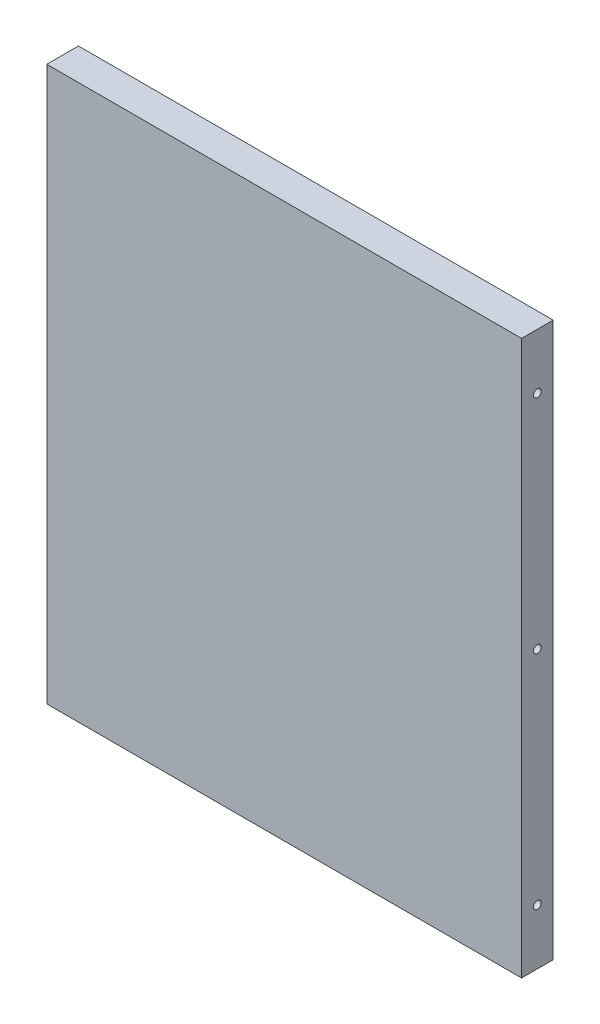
ISO-10303-21;
HEADER;
FILE_DESCRIPTION(('STEP AP214'),'2;1');
FILE_NAME('part.step','',(''),(''),'','','');
FILE_SCHEMA(('AUTOMOTIVE_DESIGN { 1 0 10303 214 1 1 1 1 }'));
ENDSEC;
DATA;
#1=APPLICATION_CONTEXT('core data for automotive mechanical design processes');
#2=APPLICATION_PROTOCOL_DEFINITION('international standard','automotive_design',2000,#1);
#3=PRODUCT_CONTEXT('',#1,'mechanical');
#4=PRODUCT('Part','Part','',(#3));
#5=PRODUCT_RELATED_PRODUCT_CATEGORY('part','',(#4));
#6=PRODUCT_DEFINITION_FORMATION('','',#4);
#7=PRODUCT_DEFINITION_CONTEXT('part definition',#1,'design');
#8=PRODUCT_DEFINITION('design','',#6,#7);
#9=PRODUCT_DEFINITION_SHAPE('','',#8);
#10=(LENGTH_UNIT() NAMED_UNIT(*) SI_UNIT(.MILLI.,.METRE.));
#11=(NAMED_UNIT(*) PLANE_ANGLE_UNIT() SI_UNIT($,.RADIAN.));
#12=(NAMED_UNIT(*) SI_UNIT($,.STERADIAN.) SOLID_ANGLE_UNIT());
#13=UNCERTAINTY_MEASURE_WITH_UNIT(LENGTH_MEASURE(1.E-05),#10,'distance_accuracy_value','');
#14=(GEOMETRIC_REPRESENTATION_CONTEXT(3) GLOBAL_UNCERTAINTY_ASSIGNED_CONTEXT((#13)) GLOBAL_UNIT_ASSIGNED_CONTEXT((#10,
#11,#12)) REPRESENTATION_CONTEXT('',''));
#15=CARTESIAN_POINT('',(0.,0.,0.));
#16=DIRECTION('',(0.,0.,1.));
#17=DIRECTION('',(1.,0.,0.));
#18=AXIS2_PLACEMENT_3D('',#15,#16,#17);
#19=CARTESIAN_POINT('',(-84.7009024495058,65.5769230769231,10.));
#20=DIRECTION('',(1.,0.,0.));
#21=DIRECTION('',(0.,1.,0.));
#22=AXIS2_PLACEMENT_3D('',#19,#20,#21);
#23=PLANE('',#22);
#24=CARTESIAN_POINT('',(-84.7009024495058,48.0769230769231,4.99999999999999));
#25=DIRECTION('',(-1.,0.,0.));
#26=DIRECTION('',(0.,-1.,0.));
#27=AXIS2_PLACEMENT_3D('',#24,#25,#26);
#28=CIRCLE('',#27,1.25);
#29=CARTESIAN_POINT('',(-84.7009024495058,46.8269230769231,4.99999999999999));
#30=VERTEX_POINT('',#29);
#31=EDGE_CURVE('E122',#30,#30,#28,.T.);
#32=ORIENTED_EDGE('',*,*,#31,.F.);
#33=EDGE_LOOP('',(#32));
#34=FACE_BOUND('',#33,.T.);
#35=CARTESIAN_POINT('',(-84.7009024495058,-21.9230769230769,5.));
#36=DIRECTION('',(-1.,0.,0.));
#37=DIRECTION('',(0.,-1.,0.));
#38=AXIS2_PLACEMENT_3D('',#35,#36,#37);
#39=CIRCLE('',#38,1.25);
#40=CARTESIAN_POINT('',(-84.7009024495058,-23.1730769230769,5.));
#41=VERTEX_POINT('',#40);
#42=EDGE_CURVE('E116',#41,#41,#39,.T.);
#43=ORIENTED_EDGE('',*,*,#42,.F.);
#44=EDGE_LOOP('',(#43));
#45=FACE_BOUND('',#44,.T.);
#46=CARTESIAN_POINT('',(-84.7009024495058,-91.9230769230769,4.99999999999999));
#47=DIRECTION('',(-1.,0.,0.));
#48=DIRECTION('',(0.,-1.,0.));
#49=AXIS2_PLACEMENT_3D('',#46,#47,#48);
#50=CIRCLE('',#49,1.23);
#51=CARTESIAN_POINT('',(-84.7009024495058,-93.1530769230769,4.99999999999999));
#52=VERTEX_POINT('',#51);
#53=EDGE_CURVE('E109',#52,#52,#50,.T.);
#54=ORIENTED_EDGE('',*,*,#53,.F.);
#55=EDGE_LOOP('',(#54));
#56=FACE_BOUND('',#55,.T.);
#57=DIRECTION('',(0.,-1.,0.));
#58=VECTOR('',#57,1.);
#59=CARTESIAN_POINT('',(-84.7009024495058,65.5769230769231,0.));
#60=LINE('',#59,#58);
#61=CARTESIAN_POINT('',(-84.7009024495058,65.5769230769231,0.));
#62=VERTEX_POINT('',#61);
#63=CARTESIAN_POINT('',(-84.7009024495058,-109.423076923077,0.));
#64=VERTEX_POINT('',#63);
#65=EDGE_CURVE('E95',#62,#64,#60,.T.);
#66=ORIENTED_EDGE('',*,*,#65,.T.);
#67=DIRECTION('',(0.,0.,-1.));
#68=VECTOR('',#67,1.);
#69=CARTESIAN_POINT('',(-84.7009024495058,-109.423076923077,10.));
#70=LINE('',#69,#68);
#71=CARTESIAN_POINT('',(-84.7009024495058,-109.423076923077,10.));
#72=VERTEX_POINT('',#71);
#73=EDGE_CURVE('E11',#72,#64,#70,.T.);
#74=ORIENTED_EDGE('',*,*,#73,.F.);
#75=DIRECTION('',(0.,-1.,0.));
#76=VECTOR('',#75,1.);
#77=CARTESIAN_POINT('',(-84.7009024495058,65.5769230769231,10.));
#78=LINE('',#77,#76);
#79=CARTESIAN_POINT('',(-84.7009024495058,65.5769230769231,10.));
#80=VERTEX_POINT('',#79);
#81=EDGE_CURVE('E83',#80,#72,#78,.T.);
#82=ORIENTED_EDGE('',*,*,#81,.F.);
#83=DIRECTION('',(0.,0.,-1.));
#84=VECTOR('',#83,1.);
#85=CARTESIAN_POINT('',(-84.7009024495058,65.5769230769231,10.));
#86=LINE('',#85,#84);
#87=EDGE_CURVE('E91',#80,#62,#86,.T.);
#88=ORIENTED_EDGE('',*,*,#87,.T.);
#89=EDGE_LOOP('',(#66,#74,#82,#88));
#90=FACE_BOUND('',#89,.T.);
#91=ADVANCED_FACE('F32',(#34,#45,#56,#90),#23,.F.);
#92=CARTESIAN_POINT('',(-84.7009024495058,-109.423076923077,10.));
#93=DIRECTION('',(0.,1.,0.));
#94=DIRECTION('',(0.,0.,1.));
#95=AXIS2_PLACEMENT_3D('',#92,#93,#94);
#96=PLANE('',#95);
#97=DIRECTION('',(1.,0.,0.));
#98=VECTOR('',#97,1.);
#99=CARTESIAN_POINT('',(-84.7009024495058,-109.423076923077,0.));
#100=LINE('',#99,#98);
#101=CARTESIAN_POINT('',(65.2990975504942,-109.423076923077,0.));
#102=VERTEX_POINT('',#101);
#103=EDGE_CURVE('E87',#64,#102,#100,.T.);
#104=ORIENTED_EDGE('',*,*,#103,.T.);
#105=DIRECTION('',(0.,0.,-1.));
#106=VECTOR('',#105,1.);
#107=CARTESIAN_POINT('',(65.2990975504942,-109.423076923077,10.));
#108=LINE('',#107,#106);
#109=CARTESIAN_POINT('',(65.2990975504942,-109.423076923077,10.));
#110=VERTEX_POINT('',#109);
#111=EDGE_CURVE('E40',#110,#102,#108,.T.);
#112=ORIENTED_EDGE('',*,*,#111,.F.);
#113=DIRECTION('',(1.,0.,0.));
#114=VECTOR('',#113,1.);
#115=CARTESIAN_POINT('',(-84.7009024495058,-109.423076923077,10.));
#116=LINE('',#115,#114);
#117=EDGE_CURVE('E78',#72,#110,#116,.T.);
#118=ORIENTED_EDGE('',*,*,#117,.F.);
#119=ORIENTED_EDGE('',*,*,#73,.T.);
#120=EDGE_LOOP('',(#104,#112,#118,#119));
#121=FACE_BOUND('',#120,.T.);
#122=ADVANCED_FACE('F86',(#121),#96,.F.);
#123=CARTESIAN_POINT('',(65.2990975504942,65.5769230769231,10.));
#124=DIRECTION('',(-1.,0.,0.));
#125=DIRECTION('',(0.,-1.,0.));
#126=AXIS2_PLACEMENT_3D('',#123,#124,#125);
#127=PLANE('',#126);
#128=CARTESIAN_POINT('',(65.2990975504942,48.0769230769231,5.));
#129=DIRECTION('',(1.,0.,0.));
#130=DIRECTION('',(0.,1.,0.));
#131=AXIS2_PLACEMENT_3D('',#128,#129,#130);
#132=CIRCLE('',#131,1.23);
#133=CARTESIAN_POINT('',(65.2990975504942,49.3069230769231,5.));
#134=VERTEX_POINT('',#133);
#135=EDGE_CURVE('E139',#134,#134,#132,.T.);
#136=ORIENTED_EDGE('',*,*,#135,.F.);
#137=EDGE_LOOP('',(#136));
#138=FACE_BOUND('',#137,.T.);
#139=CARTESIAN_POINT('',(65.2990975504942,-21.9230769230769,5.));
#140=DIRECTION('',(1.,0.,0.));
#141=DIRECTION('',(0.,1.,0.));
#142=AXIS2_PLACEMENT_3D('',#139,#140,#141);
#143=CIRCLE('',#142,1.23);
#144=CARTESIAN_POINT('',(65.2990975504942,-20.6930769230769,5.));
#145=VERTEX_POINT('',#144);
#146=EDGE_CURVE('E133',#145,#145,#143,.T.);
#147=ORIENTED_EDGE('',*,*,#146,.F.);
#148=EDGE_LOOP('',(#147));
#149=FACE_BOUND('',#148,.T.);
#150=CARTESIAN_POINT('',(65.2990975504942,-91.9230769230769,5.));
#151=DIRECTION('',(1.,0.,0.));
#152=DIRECTION('',(0.,1.,0.));
#153=AXIS2_PLACEMENT_3D('',#150,#151,#152);
#154=CIRCLE('',#153,1.23);
#155=CARTESIAN_POINT('',(65.2990975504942,-90.6930769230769,5.));
#156=VERTEX_POINT('',#155);
#157=EDGE_CURVE('E127',#156,#156,#154,.T.);
#158=ORIENTED_EDGE('',*,*,#157,.F.);
#159=EDGE_LOOP('',(#158));
#160=FACE_BOUND('',#159,.T.);
#161=DIRECTION('',(0.,1.,0.));
#162=VECTOR('',#161,1.);
#163=CARTESIAN_POINT('',(65.2990975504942,65.5769230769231,0.));
#164=LINE('',#163,#162);
#165=CARTESIAN_POINT('',(65.2990975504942,65.5769230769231,0.));
#166=VERTEX_POINT('',#165);
#167=EDGE_CURVE('E65',#102,#166,#164,.T.);
#168=ORIENTED_EDGE('',*,*,#167,.T.);
#169=DIRECTION('',(0.,0.,-1.));
#170=VECTOR('',#169,1.);
#171=CARTESIAN_POINT('',(65.2990975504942,65.5769230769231,10.));
#172=LINE('',#171,#170);
#173=CARTESIAN_POINT('',(65.2990975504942,65.5769230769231,10.));
#174=VERTEX_POINT('',#173);
#175=EDGE_CURVE('E88',#174,#166,#172,.T.);
#176=ORIENTED_EDGE('',*,*,#175,.F.);
#177=DIRECTION('',(0.,1.,0.));
#178=VECTOR('',#177,1.);
#179=CARTESIAN_POINT('',(65.2990975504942,65.5769230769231,10.));
#180=LINE('',#179,#178);
#181=EDGE_CURVE('E81',#110,#174,#180,.T.);
#182=ORIENTED_EDGE('',*,*,#181,.F.);
#183=ORIENTED_EDGE('',*,*,#111,.T.);
#184=EDGE_LOOP('',(#168,#176,#182,#183));
#185=FACE_BOUND('',#184,.T.);
#186=ADVANCED_FACE('F89',(#138,#149,#160,#185),#127,.F.);
#187=CARTESIAN_POINT('',(-84.7009024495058,65.5769230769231,10.));
#188=DIRECTION('',(0.,-1.,0.));
#189=DIRECTION('',(0.,0.,-1.));
#190=AXIS2_PLACEMENT_3D('',#187,#188,#189);
#191=PLANE('',#190);
#192=DIRECTION('',(-1.,0.,0.));
#193=VECTOR('',#192,1.);
#194=CARTESIAN_POINT('',(-84.7009024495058,65.5769230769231,0.));
#195=LINE('',#194,#193);
#196=EDGE_CURVE('E71',#166,#62,#195,.T.);
#197=ORIENTED_EDGE('',*,*,#196,.T.);
#198=ORIENTED_EDGE('',*,*,#87,.F.);
#199=DIRECTION('',(-1.,0.,0.));
#200=VECTOR('',#199,1.);
#201=CARTESIAN_POINT('',(-84.7009024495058,65.5769230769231,10.));
#202=LINE('',#201,#200);
#203=EDGE_CURVE('E48',#174,#80,#202,.T.);
#204=ORIENTED_EDGE('',*,*,#203,.F.);
#205=ORIENTED_EDGE('',*,*,#175,.T.);
#206=EDGE_LOOP('',(#197,#198,#204,#205));
#207=FACE_BOUND('',#206,.T.);
#208=ADVANCED_FACE('F103',(#207),#191,.F.);
#209=CARTESIAN_POINT('',(0.,0.,10.));
#210=DIRECTION('',(0.,0.,1.));
#211=DIRECTION('',(1.,0.,0.));
#212=AXIS2_PLACEMENT_3D('',#209,#210,#211);
#213=PLANE('',#212);
#214=ORIENTED_EDGE('',*,*,#81,.T.);
#215=ORIENTED_EDGE('',*,*,#117,.T.);
#216=ORIENTED_EDGE('',*,*,#181,.T.);
#217=ORIENTED_EDGE('',*,*,#203,.T.);
#218=EDGE_LOOP('',(#214,#215,#216,#217));
#219=FACE_BOUND('',#218,.T.);
#220=ADVANCED_FACE('F79',(#219),#213,.T.);
#221=CARTESIAN_POINT('',(0.,0.,0.));
#222=DIRECTION('',(0.,0.,1.));
#223=DIRECTION('',(1.,0.,0.));
#224=AXIS2_PLACEMENT_3D('',#221,#222,#223);
#225=PLANE('',#224);
#226=ORIENTED_EDGE('',*,*,#65,.F.);
#227=ORIENTED_EDGE('',*,*,#196,.F.);
#228=ORIENTED_EDGE('',*,*,#167,.F.);
#229=ORIENTED_EDGE('',*,*,#103,.F.);
#230=EDGE_LOOP('',(#226,#227,#228,#229));
#231=FACE_BOUND('',#230,.T.);
#232=ADVANCED_FACE('F106',(#231),#225,.F.);
#233=CARTESIAN_POINT('',(-79.7009024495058,-91.9230769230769,4.99999999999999));
#234=DIRECTION('',(-1.,0.,0.));
#235=DIRECTION('',(0.,-1.,0.));
#236=AXIS2_PLACEMENT_3D('',#233,#234,#235);
#237=CYLINDRICAL_SURFACE('',#236,1.23);
#238=CARTESIAN_POINT('',(-79.7009024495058,-91.9230769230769,4.99999999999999));
#239=DIRECTION('',(-1.,0.,0.));
#240=DIRECTION('',(0.,-1.,0.));
#241=AXIS2_PLACEMENT_3D('',#238,#239,#240);
#242=CIRCLE('',#241,1.23);
#243=CARTESIAN_POINT('',(-79.7009024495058,-93.1530769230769,4.99999999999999));
#244=VERTEX_POINT('',#243);
#245=EDGE_CURVE('E112',#244,#244,#242,.T.);
#246=ORIENTED_EDGE('',*,*,#245,.F.);
#247=EDGE_LOOP('',(#246));
#248=FACE_BOUND('',#247,.T.);
#249=ORIENTED_EDGE('',*,*,#53,.T.);
#250=EDGE_LOOP('',(#249));
#251=FACE_BOUND('',#250,.T.);
#252=ADVANCED_FACE('F191',(#248,#251),#237,.F.);
#253=CARTESIAN_POINT('',(-79.7009024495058,-91.9230769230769,4.99999999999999));
#254=DIRECTION('',(-1.,0.,0.));
#255=DIRECTION('',(0.,-1.,0.));
#256=AXIS2_PLACEMENT_3D('',#253,#254,#255);
#257=PLANE('',#256);
#258=ORIENTED_EDGE('',*,*,#245,.T.);
#259=EDGE_LOOP('',(#258));
#260=FACE_BOUND('',#259,.T.);
#261=ADVANCED_FACE('F193',(#260),#257,.T.);
#262=CARTESIAN_POINT('',(-79.7009024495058,-21.9230769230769,5.));
#263=DIRECTION('',(-1.,0.,0.));
#264=DIRECTION('',(0.,-1.,0.));
#265=AXIS2_PLACEMENT_3D('',#262,#263,#264);
#266=CYLINDRICAL_SURFACE('',#265,1.25);
#267=CARTESIAN_POINT('',(-79.7009024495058,-21.9230769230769,5.));
#268=DIRECTION('',(-1.,0.,0.));
#269=DIRECTION('',(0.,-1.,0.));
#270=AXIS2_PLACEMENT_3D('',#267,#268,#269);
#271=CIRCLE('',#270,1.25);
#272=CARTESIAN_POINT('',(-79.7009024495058,-23.1730769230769,5.));
#273=VERTEX_POINT('',#272);
#274=EDGE_CURVE('E119',#273,#273,#271,.T.);
#275=ORIENTED_EDGE('',*,*,#274,.F.);
#276=EDGE_LOOP('',(#275));
#277=FACE_BOUND('',#276,.T.);
#278=ORIENTED_EDGE('',*,*,#42,.T.);
#279=EDGE_LOOP('',(#278));
#280=FACE_BOUND('',#279,.T.);
#281=ADVANCED_FACE('F199',(#277,#280),#266,.F.);
#282=CARTESIAN_POINT('',(-79.7009024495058,-21.9230769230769,5.));
#283=DIRECTION('',(-1.,0.,0.));
#284=DIRECTION('',(0.,-1.,0.));
#285=AXIS2_PLACEMENT_3D('',#282,#283,#284);
#286=PLANE('',#285);
#287=ORIENTED_EDGE('',*,*,#274,.T.);
#288=EDGE_LOOP('',(#287));
#289=FACE_BOUND('',#288,.T.);
#290=ADVANCED_FACE('F243',(#289),#286,.T.);
#291=CARTESIAN_POINT('',(-79.7009024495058,48.0769230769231,4.99999999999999));
#292=DIRECTION('',(-1.,0.,0.));
#293=DIRECTION('',(0.,-1.,0.));
#294=AXIS2_PLACEMENT_3D('',#291,#292,#293);
#295=CYLINDRICAL_SURFACE('',#294,1.25);
#296=CARTESIAN_POINT('',(-79.7009024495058,48.0769230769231,4.99999999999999));
#297=DIRECTION('',(-1.,0.,0.));
#298=DIRECTION('',(0.,-1.,0.));
#299=AXIS2_PLACEMENT_3D('',#296,#297,#298);
#300=CIRCLE('',#299,1.25);
#301=CARTESIAN_POINT('',(-79.7009024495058,46.8269230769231,4.99999999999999));
#302=VERTEX_POINT('',#301);
#303=EDGE_CURVE('E98',#302,#302,#300,.T.);
#304=ORIENTED_EDGE('',*,*,#303,.F.);
#305=EDGE_LOOP('',(#304));
#306=FACE_BOUND('',#305,.T.);
#307=ORIENTED_EDGE('',*,*,#31,.T.);
#308=EDGE_LOOP('',(#307));
#309=FACE_BOUND('',#308,.T.);
#310=ADVANCED_FACE('F174',(#306,#309),#295,.F.);
#311=CARTESIAN_POINT('',(-79.7009024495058,48.0769230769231,4.99999999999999));
#312=DIRECTION('',(-1.,0.,0.));
#313=DIRECTION('',(0.,-1.,0.));
#314=AXIS2_PLACEMENT_3D('',#311,#312,#313);
#315=PLANE('',#314);
#316=ORIENTED_EDGE('',*,*,#303,.T.);
#317=EDGE_LOOP('',(#316));
#318=FACE_BOUND('',#317,.T.);
#319=ADVANCED_FACE('F164',(#318),#315,.T.);
#320=CARTESIAN_POINT('',(60.2990975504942,-91.9230769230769,5.));
#321=DIRECTION('',(1.,0.,0.));
#322=DIRECTION('',(0.,1.,0.));
#323=AXIS2_PLACEMENT_3D('',#320,#321,#322);
#324=CYLINDRICAL_SURFACE('',#323,1.23);
#325=CARTESIAN_POINT('',(60.2990975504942,-91.9230769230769,5.));
#326=DIRECTION('',(1.,0.,0.));
#327=DIRECTION('',(0.,1.,0.));
#328=AXIS2_PLACEMENT_3D('',#325,#326,#327);
#329=CIRCLE('',#328,1.23);
#330=CARTESIAN_POINT('',(60.2990975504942,-90.6930769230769,5.));
#331=VERTEX_POINT('',#330);
#332=EDGE_CURVE('E130',#331,#331,#329,.T.);
#333=ORIENTED_EDGE('',*,*,#332,.F.);
#334=EDGE_LOOP('',(#333));
#335=FACE_BOUND('',#334,.T.);
#336=ORIENTED_EDGE('',*,*,#157,.T.);
#337=EDGE_LOOP('',(#336));
#338=FACE_BOUND('',#337,.T.);
#339=ADVANCED_FACE('F161',(#335,#338),#324,.F.);
#340=CARTESIAN_POINT('',(60.2990975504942,-91.9230769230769,5.));
#341=DIRECTION('',(1.,0.,0.));
#342=DIRECTION('',(0.,1.,0.));
#343=AXIS2_PLACEMENT_3D('',#340,#341,#342);
#344=PLANE('',#343);
#345=ORIENTED_EDGE('',*,*,#332,.T.);
#346=EDGE_LOOP('',(#345));
#347=FACE_BOUND('',#346,.T.);
#348=ADVANCED_FACE('F163',(#347),#344,.T.);
#349=CARTESIAN_POINT('',(60.2990975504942,-21.9230769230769,5.));
#350=DIRECTION('',(1.,0.,0.));
#351=DIRECTION('',(0.,1.,0.));
#352=AXIS2_PLACEMENT_3D('',#349,#350,#351);
#353=CYLINDRICAL_SURFACE('',#352,1.23);
#354=CARTESIAN_POINT('',(60.2990975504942,-21.9230769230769,5.));
#355=DIRECTION('',(1.,0.,0.));
#356=DIRECTION('',(0.,1.,0.));
#357=AXIS2_PLACEMENT_3D('',#354,#355,#356);
#358=CIRCLE('',#357,1.23);
#359=CARTESIAN_POINT('',(60.2990975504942,-20.6930769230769,5.));
#360=VERTEX_POINT('',#359);
#361=EDGE_CURVE('E136',#360,#360,#358,.T.);
#362=ORIENTED_EDGE('',*,*,#361,.F.);
#363=EDGE_LOOP('',(#362));
#364=FACE_BOUND('',#363,.T.);
#365=ORIENTED_EDGE('',*,*,#146,.T.);
#366=EDGE_LOOP('',(#365));
#367=FACE_BOUND('',#366,.T.);
#368=ADVANCED_FACE('F171',(#364,#367),#353,.F.);
#369=CARTESIAN_POINT('',(60.2990975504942,-21.9230769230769,5.));
#370=DIRECTION('',(1.,0.,0.));
#371=DIRECTION('',(0.,1.,0.));
#372=AXIS2_PLACEMENT_3D('',#369,#370,#371);
#373=PLANE('',#372);
#374=ORIENTED_EDGE('',*,*,#361,.T.);
#375=EDGE_LOOP('',(#374));
#376=FACE_BOUND('',#375,.T.);
#377=ADVANCED_FACE('F150',(#376),#373,.T.);
#378=CARTESIAN_POINT('',(60.2990975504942,48.0769230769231,5.));
#379=DIRECTION('',(1.,0.,0.));
#380=DIRECTION('',(0.,1.,0.));
#381=AXIS2_PLACEMENT_3D('',#378,#379,#380);
#382=CYLINDRICAL_SURFACE('',#381,1.23);
#383=CARTESIAN_POINT('',(60.2990975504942,48.0769230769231,5.));
#384=DIRECTION('',(1.,0.,0.));
#385=DIRECTION('',(0.,1.,0.));
#386=AXIS2_PLACEMENT_3D('',#383,#384,#385);
#387=CIRCLE('',#386,1.23);
#388=CARTESIAN_POINT('',(60.2990975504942,49.3069230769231,5.));
#389=VERTEX_POINT('',#388);
#390=EDGE_CURVE('E113',#389,#389,#387,.T.);
#391=ORIENTED_EDGE('',*,*,#390,.F.);
#392=EDGE_LOOP('',(#391));
#393=FACE_BOUND('',#392,.T.);
#394=ORIENTED_EDGE('',*,*,#135,.T.);
#395=EDGE_LOOP('',(#394));
#396=FACE_BOUND('',#395,.T.);
#397=ADVANCED_FACE('F147',(#393,#396),#382,.F.);
#398=CARTESIAN_POINT('',(60.2990975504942,48.0769230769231,5.));
#399=DIRECTION('',(1.,0.,0.));
#400=DIRECTION('',(0.,1.,0.));
#401=AXIS2_PLACEMENT_3D('',#398,#399,#400);
#402=PLANE('',#401);
#403=ORIENTED_EDGE('',*,*,#390,.T.);
#404=EDGE_LOOP('',(#403));
#405=FACE_BOUND('',#404,.T.);
#406=ADVANCED_FACE('F145',(#405),#402,.T.);
#407=CLOSED_SHELL('',(#91,#122,#186,#208,#220,#232,#252,#261,#281,#290,#310,#319,#339,#348,#368,
#377,#397,#406));
#408=MANIFOLD_SOLID_BREP('B2',#407);
#409=ADVANCED_BREP_SHAPE_REPRESENTATION('',(#18,#408),#14);
#410=SHAPE_DEFINITION_REPRESENTATION(#9,#409);
ENDSEC;
END-ISO-10303-21;
